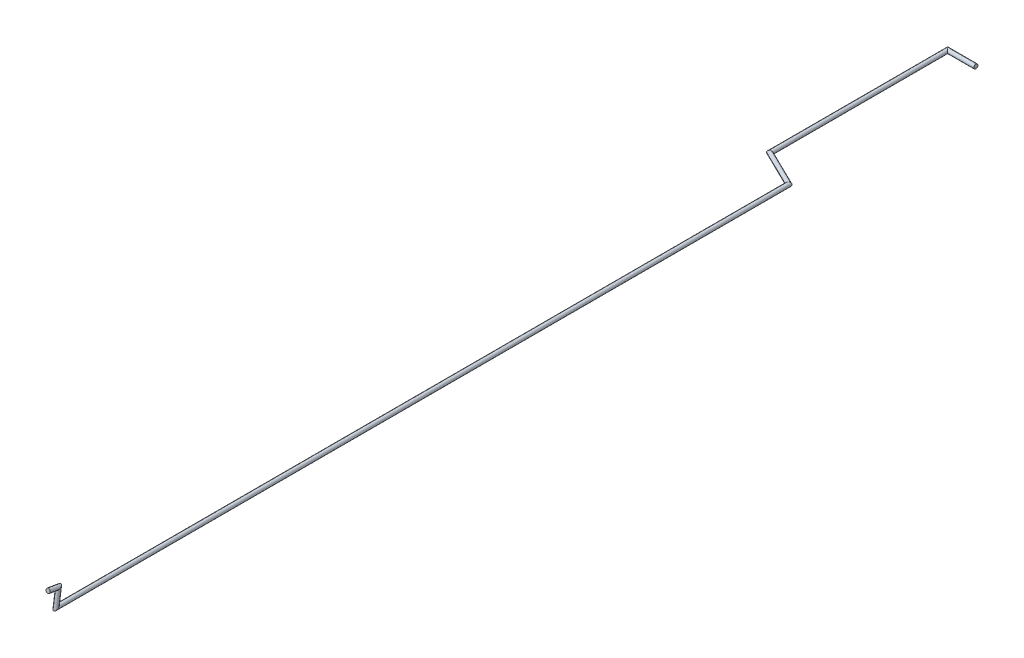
ISO-10303-21;
HEADER;
FILE_DESCRIPTION(('STEP AP214'),'2;1');
FILE_NAME('part.step','',(''),(''),'','','');
FILE_SCHEMA(('AUTOMOTIVE_DESIGN { 1 0 10303 214 1 1 1 1 }'));
ENDSEC;
DATA;
#1=APPLICATION_CONTEXT('core data for automotive mechanical design processes');
#2=APPLICATION_PROTOCOL_DEFINITION('international standard','automotive_design',2000,#1);
#3=PRODUCT_CONTEXT('',#1,'mechanical');
#4=PRODUCT('Part','Part','',(#3));
#5=PRODUCT_RELATED_PRODUCT_CATEGORY('part','',(#4));
#6=PRODUCT_DEFINITION_FORMATION('','',#4);
#7=PRODUCT_DEFINITION_CONTEXT('part definition',#1,'design');
#8=PRODUCT_DEFINITION('design','',#6,#7);
#9=PRODUCT_DEFINITION_SHAPE('','',#8);
#10=(LENGTH_UNIT() NAMED_UNIT(*) SI_UNIT(.MILLI.,.METRE.));
#11=(NAMED_UNIT(*) PLANE_ANGLE_UNIT() SI_UNIT($,.RADIAN.));
#12=(NAMED_UNIT(*) SI_UNIT($,.STERADIAN.) SOLID_ANGLE_UNIT());
#13=UNCERTAINTY_MEASURE_WITH_UNIT(LENGTH_MEASURE(1.E-05),#10,'distance_accuracy_value','');
#14=(GEOMETRIC_REPRESENTATION_CONTEXT(3) GLOBAL_UNCERTAINTY_ASSIGNED_CONTEXT((#13)) GLOBAL_UNIT_ASSIGNED_CONTEXT((#10,
#11,#12)) REPRESENTATION_CONTEXT('',''));
#15=CARTESIAN_POINT('',(0.,0.,0.));
#16=DIRECTION('',(0.,0.,1.));
#17=DIRECTION('',(1.,0.,0.));
#18=AXIS2_PLACEMENT_3D('',#15,#16,#17);
#19=CARTESIAN_POINT('',(2.3999999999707,4.72593118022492,265.608730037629));
#20=DIRECTION('',(0.,0.163254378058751,0.986584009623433));
#21=DIRECTION('',(0.,-0.986584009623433,0.163254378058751));
#22=AXIS2_PLACEMENT_3D('',#19,#20,#21);
#23=CYLINDRICAL_SURFACE('',#22,0.6);
#24=CARTESIAN_POINT('',(2.3999999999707,4.72593118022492,265.608730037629));
#25=DIRECTION('',(-4.29706477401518E-12,0.805544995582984,0.592534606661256));
#26=DIRECTION('',(-4.39600428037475E-12,0.592534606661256,-0.805544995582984));
#27=AXIS2_PLACEMENT_3D('',#24,#25,#26);
#28=ELLIPSE('',#27,0.837878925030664,0.6);
#29=CARTESIAN_POINT('',(2.39999999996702,5.22240343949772,264.933780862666));
#30=VERTEX_POINT('',#29);
#31=EDGE_CURVE('E41',#30,#30,#28,.F.);
#32=ORIENTED_EDGE('',*,*,#31,.F.);
#33=EDGE_LOOP('',(#32));
#34=FACE_BOUND('',#33,.T.);
#35=CARTESIAN_POINT('',(2.39999999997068,5.21569431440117,268.568482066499));
#36=DIRECTION('',(0.,0.163254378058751,0.986584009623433));
#37=DIRECTION('',(0.,-0.986584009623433,0.163254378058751));
#38=AXIS2_PLACEMENT_3D('',#35,#36,#37);
#39=CIRCLE('',#38,0.6);
#40=CARTESIAN_POINT('',(2.39999999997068,4.62374390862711,268.666434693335));
#41=VERTEX_POINT('',#40);
#42=EDGE_CURVE('E11',#41,#41,#39,.T.);
#43=ORIENTED_EDGE('',*,*,#42,.F.);
#44=EDGE_LOOP('',(#43));
#45=FACE_BOUND('',#44,.T.);
#46=ADVANCED_FACE('F35',(#34,#45),#23,.T.);
#47=CARTESIAN_POINT('',(2.40000000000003,0.,266.267029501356));
#48=DIRECTION('',(-6.14553025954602E-12,0.990437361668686,-0.137963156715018));
#49=DIRECTION('',(0.,0.137963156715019,0.990437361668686));
#50=AXIS2_PLACEMENT_3D('',#47,#48,#49);
#51=CYLINDRICAL_SURFACE('',#50,0.6);
#52=CARTESIAN_POINT('',(2.40000000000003,0.,266.267029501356));
#53=DIRECTION('',(-4.68033331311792E-12,0.754308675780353,0.656519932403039));
#54=DIRECTION('',(4.07366141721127E-12,-0.656519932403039,0.754308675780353));
#55=AXIS2_PLACEMENT_3D('',#52,#53,#54);
#56=ELLIPSE('',#55,0.913909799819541,0.6);
#57=CARTESIAN_POINT('',(2.40000000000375,-0.600000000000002,266.956399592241));
#58=VERTEX_POINT('',#57);
#59=EDGE_CURVE('E45',#58,#58,#56,.T.);
#60=ORIENTED_EDGE('',*,*,#59,.T.);
#61=EDGE_LOOP('',(#60));
#62=FACE_BOUND('',#61,.T.);
#63=ORIENTED_EDGE('',*,*,#31,.T.);
#64=EDGE_LOOP('',(#63));
#65=FACE_BOUND('',#64,.T.);
#66=ADVANCED_FACE('F88',(#62,#65),#51,.T.);
#67=CARTESIAN_POINT('',(2.40000000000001,0.,56.1211921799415));
#68=DIRECTION('',(0.,0.,1.));
#69=DIRECTION('',(1.,0.,0.));
#70=AXIS2_PLACEMENT_3D('',#67,#68,#69);
#71=CYLINDRICAL_SURFACE('',#70,0.6);
#72=CARTESIAN_POINT('',(2.40000000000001,0.,56.1211921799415));
#73=DIRECTION('',(0.529919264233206,0.,0.848048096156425));
#74=DIRECTION('',(0.848048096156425,0.,-0.529919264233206));
#75=AXIS2_PLACEMENT_3D('',#72,#73,#74);
#76=ELLIPSE('',#75,0.707507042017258,0.6);
#77=CARTESIAN_POINT('',(3.00000000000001,0.,55.7462705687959));
#78=VERTEX_POINT('',#77);
#79=EDGE_CURVE('E49',#78,#78,#76,.F.);
#80=ORIENTED_EDGE('',*,*,#79,.F.);
#81=EDGE_LOOP('',(#80));
#82=FACE_BOUND('',#81,.T.);
#83=ORIENTED_EDGE('',*,*,#59,.F.);
#84=EDGE_LOOP('',(#83));
#85=FACE_BOUND('',#84,.T.);
#86=ADVANCED_FACE('F82',(#82,#85),#71,.T.);
#87=CARTESIAN_POINT('',(-8.1,0.,51.));
#88=DIRECTION('',(0.898794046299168,0.,0.438371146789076));
#89=DIRECTION('',(0.438371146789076,0.,-0.898794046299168));
#90=AXIS2_PLACEMENT_3D('',#87,#88,#89);
#91=CYLINDRICAL_SURFACE('',#90,0.6);
#92=CARTESIAN_POINT('',(-8.1,0.,51.));
#93=DIRECTION('',(0.529919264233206,0.,0.848048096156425));
#94=DIRECTION('',(-0.848048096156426,0.,0.529919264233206));
#95=AXIS2_PLACEMENT_3D('',#92,#93,#94);
#96=ELLIPSE('',#95,0.707507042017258,0.6);
#97=CARTESIAN_POINT('',(-8.7,0.,51.3749216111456));
#98=VERTEX_POINT('',#97);
#99=EDGE_CURVE('E54',#98,#98,#96,.T.);
#100=ORIENTED_EDGE('',*,*,#99,.T.);
#101=EDGE_LOOP('',(#100));
#102=FACE_BOUND('',#101,.T.);
#103=ORIENTED_EDGE('',*,*,#79,.T.);
#104=EDGE_LOOP('',(#103));
#105=FACE_BOUND('',#104,.T.);
#106=ADVANCED_FACE('F76',(#102,#105),#91,.T.);
#107=CARTESIAN_POINT('',(-8.1,0.,0.));
#108=DIRECTION('',(0.,0.,1.));
#109=DIRECTION('',(1.,0.,0.));
#110=AXIS2_PLACEMENT_3D('',#107,#108,#109);
#111=CYLINDRICAL_SURFACE('',#110,0.6);
#112=CARTESIAN_POINT('',(-8.1,0.,0.));
#113=DIRECTION('',(-0.707106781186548,0.,0.707106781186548));
#114=DIRECTION('',(0.707106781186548,0.,0.707106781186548));
#115=AXIS2_PLACEMENT_3D('',#112,#113,#114);
#116=ELLIPSE('',#115,0.848528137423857,0.6);
#117=CARTESIAN_POINT('',(-7.5,0.,0.6));
#118=VERTEX_POINT('',#117);
#119=EDGE_CURVE('E57',#118,#118,#116,.F.);
#120=ORIENTED_EDGE('',*,*,#119,.F.);
#121=EDGE_LOOP('',(#120));
#122=FACE_BOUND('',#121,.T.);
#123=ORIENTED_EDGE('',*,*,#99,.F.);
#124=EDGE_LOOP('',(#123));
#125=FACE_BOUND('',#124,.T.);
#126=ADVANCED_FACE('F73',(#122,#125),#111,.T.);
#127=CARTESIAN_POINT('',(0.,0.,0.));
#128=DIRECTION('',(1.,0.,0.));
#129=DIRECTION('',(0.,0.,-1.));
#130=AXIS2_PLACEMENT_3D('',#127,#128,#129);
#131=PLANE('',#130);
#132=CARTESIAN_POINT('',(0.,0.,0.));
#133=DIRECTION('',(1.,0.,0.));
#134=DIRECTION('',(0.,0.,-1.));
#135=AXIS2_PLACEMENT_3D('',#132,#133,#134);
#136=CIRCLE('',#135,0.6);
#137=CARTESIAN_POINT('',(0.,0.,-0.6));
#138=VERTEX_POINT('',#137);
#139=EDGE_CURVE('E60',#138,#138,#136,.T.);
#140=ORIENTED_EDGE('',*,*,#139,.T.);
#141=EDGE_LOOP('',(#140));
#142=FACE_BOUND('',#141,.T.);
#143=ADVANCED_FACE('F64',(#142),#131,.T.);
#144=CARTESIAN_POINT('',(-9.79705627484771,0.,0.));
#145=DIRECTION('',(1.,0.,0.));
#146=DIRECTION('',(0.,0.,-1.));
#147=AXIS2_PLACEMENT_3D('',#144,#145,#146);
#148=CYLINDRICAL_SURFACE('',#147,0.6);
#149=ORIENTED_EDGE('',*,*,#139,.F.);
#150=EDGE_LOOP('',(#149));
#151=FACE_BOUND('',#150,.T.);
#152=ORIENTED_EDGE('',*,*,#119,.T.);
#153=EDGE_LOOP('',(#152));
#154=FACE_BOUND('',#153,.T.);
#155=ADVANCED_FACE('F66',(#151,#154),#148,.T.);
#156=CARTESIAN_POINT('',(2.39999999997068,5.21569431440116,268.568482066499));
#157=DIRECTION('',(0.,0.163254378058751,0.986584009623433));
#158=DIRECTION('',(0.,-0.986584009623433,0.163254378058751));
#159=AXIS2_PLACEMENT_3D('',#156,#157,#158);
#160=PLANE('',#159);
#161=ORIENTED_EDGE('',*,*,#42,.T.);
#162=EDGE_LOOP('',(#161));
#163=FACE_BOUND('',#162,.T.);
#164=ADVANCED_FACE('F69',(#163),#160,.T.);
#165=CLOSED_SHELL('',(#46,#66,#86,#106,#126,#143,#155,#164));
#166=MANIFOLD_SOLID_BREP('B2',#165);
#167=ADVANCED_BREP_SHAPE_REPRESENTATION('',(#18,#166),#14);
#168=SHAPE_DEFINITION_REPRESENTATION(#9,#167);
ENDSEC;
END-ISO-10303-21;
